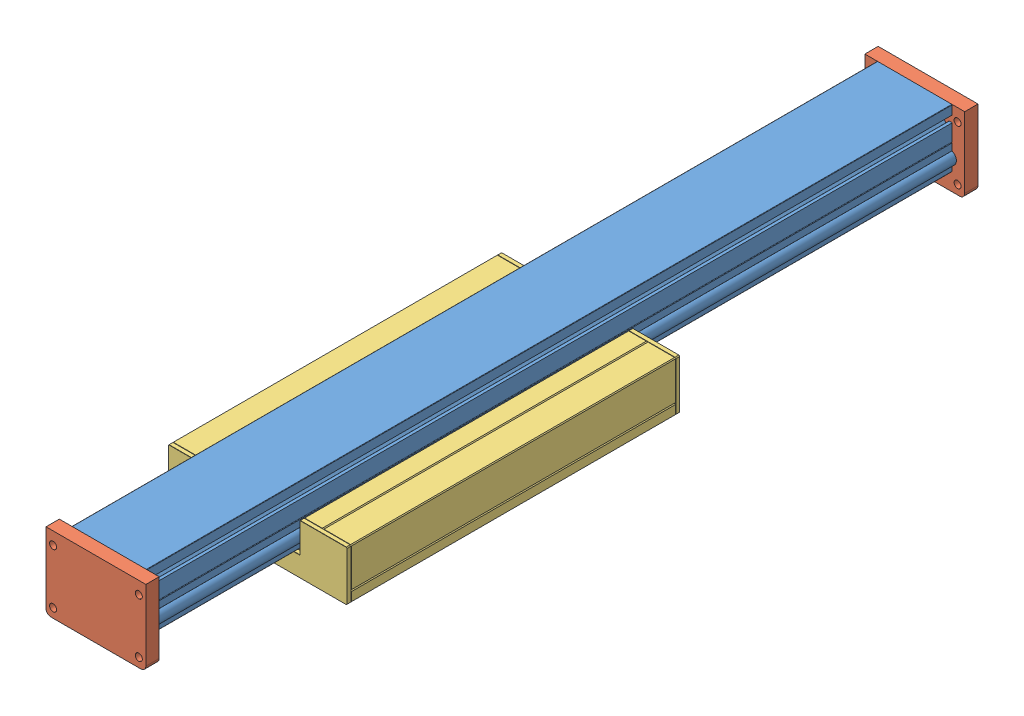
SolidWorks assembly MO090_400_1000.SLDASM, configuration Standard (file format 3800). Lengths in mm.
Overall size (215 95 1000).
4 component instances, 3 part files, 8 mates.
Components (placement in the parent):
- Profil_MZ090-1: Profil_MZ090.SLDPRT [l=968] at origin size (100.1 70 968)
- Endplatte_MO090-1: Endplatte_MO090.SLDPRT [vereinfacht] at (0 -13 0) x (0 0 1) z (1 0 0) size (16 91 120)
- Endplatte_MO090-2: Endplatte_MO090.SLDPRT [vereinfacht] at (0 -13 968) x (0 0 -1) z (-1 0 0) size (16 91 120)
- Schlitten_MZK090_400-1: Schlitten_MZK090_400.SLDPRT [Standard] at (0 35 589.7811) x (-1 0 0) z (0 0 1) size (215 60 400)
Mates (geometry in assembly coordinates):
- Deckungsgleich1: coincident anti-aligned: plane of Profil_MZ090-1 through (-45 35 0) normal (0 0 -1); plane of Endplatte_MO090-1 through (-54 -50 0) normal (0 0 1)
- Deckungsgleich2: coincident aligned: plane of Endplatte_MO090-1 through (60 35 -16) normal (0 1 0); plane of Profil_MZ090-1 through (-45 35 968) normal (0 1 0)
- Breite1: width: plane of Endplatte_MO090-1 through (60 -50 -16) normal (1 0 0); plane of Endplatte_MO090-1 through (-60 -50 -16) normal (-1 0 0); plane of Profil_MZ090-1 through (-45 35 968) normal (-1 0 0); plane of Profil_MZ090-1 through (45 35 968) normal (1 0 0)
- Deckungsgleich3: coincident anti-aligned: plane of Profil_MZ090-1 through (-45 35 968) normal (0 0 1); plane of Endplatte_MO090-2 through (54 -50 968) normal (0 0 -1)
- Deckungsgleich4: coincident aligned: plane of Endplatte_MO090-2 through (-60 35 984) normal (0 1 0); plane of Profil_MZ090-1 through (-45 35 968) normal (0 1 0)
- Breite2: width: plane of Endplatte_MO090-2 through (60 -50 984) normal (1 0 0); plane of Endplatte_MO090-2 through (-60 -50 984) normal (-1 0 0); plane of Profil_MZ090-1 through (-45 35 968) normal (-1 0 0); plane of Profil_MZ090-1 through (45 35 968) normal (1 0 0)
- Abstand1: distance = 95 mm: plane of Profil_MZ090-1 through (-45 35 968) normal (0 1 0); plane of Schlitten_MZK090_400-1 through (-107.5 -60 784.7811) normal (0 -1 0)
- Breite3: width: plane of Schlitten_MZK090_400-1 through (107.5 -60 784.7811) normal (1 0 0); plane of Schlitten_MZK090_400-1 through (-107.5 -60 784.7811) normal (-1 0 0); plane of Profil_MZ090-1 through (-45 35 968) normal (-1 0 0); plane of Profil_MZ090-1 through (45 35 968) normal (1 0 0)
